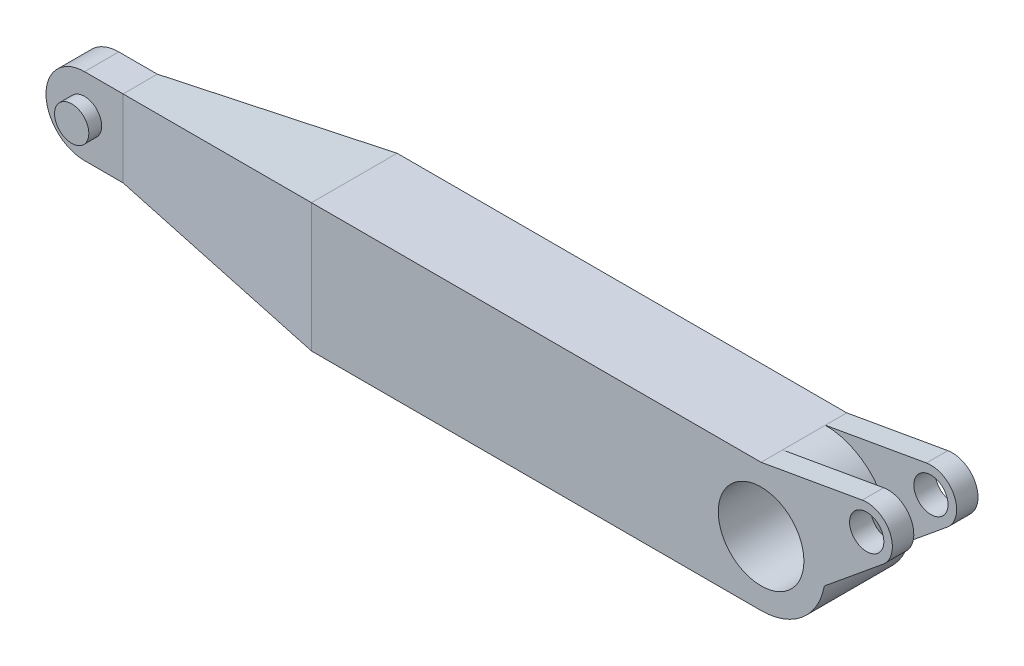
ISO-10303-21;
HEADER;
FILE_DESCRIPTION(('STEP AP214'),'2;1');
FILE_NAME('part.step','',(''),(''),'','','');
FILE_SCHEMA(('AUTOMOTIVE_DESIGN { 1 0 10303 214 1 1 1 1 }'));
ENDSEC;
DATA;
#1=APPLICATION_CONTEXT('core data for automotive mechanical design processes');
#2=APPLICATION_PROTOCOL_DEFINITION('international standard','automotive_design',2000,#1);
#3=PRODUCT_CONTEXT('',#1,'mechanical');
#4=PRODUCT('Part','Part','',(#3));
#5=PRODUCT_RELATED_PRODUCT_CATEGORY('part','',(#4));
#6=PRODUCT_DEFINITION_FORMATION('','',#4);
#7=PRODUCT_DEFINITION_CONTEXT('part definition',#1,'design');
#8=PRODUCT_DEFINITION('design','',#6,#7);
#9=PRODUCT_DEFINITION_SHAPE('','',#8);
#10=(LENGTH_UNIT() NAMED_UNIT(*) SI_UNIT(.MILLI.,.METRE.));
#11=(NAMED_UNIT(*) PLANE_ANGLE_UNIT() SI_UNIT($,.RADIAN.));
#12=(NAMED_UNIT(*) SI_UNIT($,.STERADIAN.) SOLID_ANGLE_UNIT());
#13=UNCERTAINTY_MEASURE_WITH_UNIT(LENGTH_MEASURE(1.E-05),#10,'distance_accuracy_value','');
#14=(GEOMETRIC_REPRESENTATION_CONTEXT(3) GLOBAL_UNCERTAINTY_ASSIGNED_CONTEXT((#13)) GLOBAL_UNIT_ASSIGNED_CONTEXT((#10,
#11,#12)) REPRESENTATION_CONTEXT('',''));
#15=CARTESIAN_POINT('',(0.,0.,0.));
#16=DIRECTION('',(0.,0.,1.));
#17=DIRECTION('',(1.,0.,0.));
#18=AXIS2_PLACEMENT_3D('',#15,#16,#17);
#19=CARTESIAN_POINT('',(0.,0.,0.));
#20=DIRECTION('',(0.,0.,1.));
#21=DIRECTION('',(1.,0.,0.));
#22=AXIS2_PLACEMENT_3D('',#19,#20,#21);
#23=CYLINDRICAL_SURFACE('',#22,150.);
#24=CARTESIAN_POINT('',(0.,0.,-50.));
#25=DIRECTION('',(0.,0.,1.));
#26=DIRECTION('',(1.,0.,0.));
#27=AXIS2_PLACEMENT_3D('',#24,#25,#26);
#28=CIRCLE('',#27,150.);
#29=CARTESIAN_POINT('',(150.,0.,-50.));
#30=VERTEX_POINT('',#29);
#31=CARTESIAN_POINT('',(0.,150.,-50.));
#32=VERTEX_POINT('',#31);
#33=EDGE_CURVE('E197',#30,#32,#28,.T.);
#34=ORIENTED_EDGE('',*,*,#33,.T.);
#35=DIRECTION('',(0.,0.,-1.));
#36=VECTOR('',#35,1.);
#37=CARTESIAN_POINT('',(0.,150.,-100.));
#38=LINE('',#37,#36);
#39=CARTESIAN_POINT('',(0.,150.,50.));
#40=VERTEX_POINT('',#39);
#41=EDGE_CURVE('E324',#40,#32,#38,.T.);
#42=ORIENTED_EDGE('',*,*,#41,.F.);
#43=CARTESIAN_POINT('',(0.,0.,50.));
#44=DIRECTION('',(0.,0.,1.));
#45=DIRECTION('',(1.,0.,0.));
#46=AXIS2_PLACEMENT_3D('',#43,#44,#45);
#47=CIRCLE('',#46,150.);
#48=CARTESIAN_POINT('',(150.,0.,50.));
#49=VERTEX_POINT('',#48);
#50=EDGE_CURVE('E206',#49,#40,#47,.T.);
#51=ORIENTED_EDGE('',*,*,#50,.F.);
#52=DIRECTION('',(0.,0.,-1.));
#53=VECTOR('',#52,1.);
#54=CARTESIAN_POINT('',(150.,0.,100.));
#55=LINE('',#54,#53);
#56=EDGE_CURVE('E246',#30,#49,#55,.F.);
#57=ORIENTED_EDGE('',*,*,#56,.F.);
#58=EDGE_LOOP('',(#34,#42,#51,#57));
#59=FACE_BOUND('',#58,.T.);
#60=ADVANCED_FACE('F42',(#59),#23,.T.);
#61=CARTESIAN_POINT('',(0.,0.,0.));
#62=DIRECTION('',(0.,0.,-1.));
#63=DIRECTION('',(-1.,0.,0.));
#64=AXIS2_PLACEMENT_3D('',#61,#62,#63);
#65=CYLINDRICAL_SURFACE('',#64,150.);
#66=DIRECTION('',(0.,0.,1.));
#67=VECTOR('',#66,1.);
#68=CARTESIAN_POINT('',(147.67042884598,-26.3333333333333,-476.747054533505));
#69=LINE('',#68,#67);
#70=CARTESIAN_POINT('',(147.67042884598,-26.3333333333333,-100.));
#71=VERTEX_POINT('',#70);
#72=CARTESIAN_POINT('',(147.67042884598,-26.3333333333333,-50.));
#73=VERTEX_POINT('',#72);
#74=EDGE_CURVE('E185',#71,#73,#69,.T.);
#75=ORIENTED_EDGE('',*,*,#74,.T.);
#76=EDGE_CURVE('E193',#73,#30,#28,.T.);
#77=ORIENTED_EDGE('',*,*,#76,.T.);
#78=ORIENTED_EDGE('',*,*,#56,.T.);
#79=CARTESIAN_POINT('',(147.67042884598,-26.3333333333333,50.));
#80=VERTEX_POINT('',#79);
#81=EDGE_CURVE('E202',#80,#49,#47,.T.);
#82=ORIENTED_EDGE('',*,*,#81,.F.);
#83=DIRECTION('',(0.,0.,-1.));
#84=VECTOR('',#83,1.);
#85=CARTESIAN_POINT('',(147.67042884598,-26.3333333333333,476.747054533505));
#86=LINE('',#85,#84);
#87=CARTESIAN_POINT('',(147.67042884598,-26.3333333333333,100.));
#88=VERTEX_POINT('',#87);
#89=EDGE_CURVE('E217',#88,#80,#86,.T.);
#90=ORIENTED_EDGE('',*,*,#89,.F.);
#91=CARTESIAN_POINT('',(0.,0.,100.));
#92=DIRECTION('',(0.,0.,-1.));
#93=DIRECTION('',(-1.,0.,0.));
#94=AXIS2_PLACEMENT_3D('',#91,#92,#93);
#95=CIRCLE('',#94,150.);
#96=CARTESIAN_POINT('',(0.,-150.,100.));
#97=VERTEX_POINT('',#96);
#98=EDGE_CURVE('E56',#97,#88,#95,.F.);
#99=ORIENTED_EDGE('',*,*,#98,.F.);
#100=DIRECTION('',(0.,0.,-1.));
#101=VECTOR('',#100,1.);
#102=CARTESIAN_POINT('',(0.,-150.,0.));
#103=LINE('',#102,#101);
#104=CARTESIAN_POINT('',(0.,-150.,-100.));
#105=VERTEX_POINT('',#104);
#106=EDGE_CURVE('E321',#105,#97,#103,.F.);
#107=ORIENTED_EDGE('',*,*,#106,.F.);
#108=CARTESIAN_POINT('',(0.,0.,-100.));
#109=DIRECTION('',(0.,0.,-1.));
#110=DIRECTION('',(-1.,0.,0.));
#111=AXIS2_PLACEMENT_3D('',#108,#109,#110);
#112=CIRCLE('',#111,150.);
#113=EDGE_CURVE('E317',#71,#105,#112,.T.);
#114=ORIENTED_EDGE('',*,*,#113,.F.);
#115=EDGE_LOOP('',(#75,#77,#78,#82,#90,#99,#107,#114));
#116=FACE_BOUND('',#115,.T.);
#117=ADVANCED_FACE('F329',(#116),#65,.T.);
#118=CARTESIAN_POINT('',(0.,150.,40.));
#119=DIRECTION('',(0.,0.,1.));
#120=DIRECTION('',(1.,0.,0.));
#121=AXIS2_PLACEMENT_3D('',#118,#119,#120);
#122=PLANE('',#121);
#123=CARTESIAN_POINT('',(-1640.,0.,40.0000000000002));
#124=DIRECTION('',(0.,0.,1.));
#125=DIRECTION('',(1.,0.,0.));
#126=AXIS2_PLACEMENT_3D('',#123,#124,#125);
#127=CIRCLE('',#126,39.9999999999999);
#128=CARTESIAN_POINT('',(-1600.,0.,40.0000000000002));
#129=VERTEX_POINT('',#128);
#130=EDGE_CURVE('E235',#129,#129,#127,.F.);
#131=ORIENTED_EDGE('',*,*,#130,.T.);
#132=EDGE_LOOP('',(#131));
#133=FACE_BOUND('',#132,.T.);
#134=CARTESIAN_POINT('',(-1640.,0.,40.0000000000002));
#135=DIRECTION('',(0.,0.,1.));
#136=DIRECTION('',(1.,0.,0.));
#137=AXIS2_PLACEMENT_3D('',#134,#135,#136);
#138=CIRCLE('',#137,90.);
#139=CARTESIAN_POINT('',(-1640.,90.,40.0000000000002));
#140=VERTEX_POINT('',#139);
#141=CARTESIAN_POINT('',(-1730.,0.,40.0000000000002));
#142=VERTEX_POINT('',#141);
#143=EDGE_CURVE('E304',#140,#142,#138,.T.);
#144=ORIENTED_EDGE('',*,*,#143,.T.);
#145=CARTESIAN_POINT('',(-1640.,0.,40.0000000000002));
#146=DIRECTION('',(0.,0.,1.));
#147=DIRECTION('',(1.,0.,0.));
#148=AXIS2_PLACEMENT_3D('',#145,#146,#147);
#149=CIRCLE('',#148,90.);
#150=CARTESIAN_POINT('',(-1640.,-90.,40.0000000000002));
#151=VERTEX_POINT('',#150);
#152=EDGE_CURVE('E306',#142,#151,#149,.T.);
#153=ORIENTED_EDGE('',*,*,#152,.T.);
#154=DIRECTION('',(-1.,0.,0.));
#155=VECTOR('',#154,1.);
#156=CARTESIAN_POINT('',(0.,-89.9999999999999,40.));
#157=LINE('',#156,#155);
#158=CARTESIAN_POINT('',(-1550.,-90.0000000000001,40.0000000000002));
#159=VERTEX_POINT('',#158);
#160=EDGE_CURVE('E269',#159,#151,#157,.T.);
#161=ORIENTED_EDGE('',*,*,#160,.F.);
#162=DIRECTION('',(0.,-1.,0.));
#163=VECTOR('',#162,1.);
#164=CARTESIAN_POINT('',(-1550.,150.,40.0000000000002));
#165=LINE('',#164,#163);
#166=CARTESIAN_POINT('',(-1550.,90.0000000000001,40.0000000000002));
#167=VERTEX_POINT('',#166);
#168=EDGE_CURVE('E295',#167,#159,#165,.T.);
#169=ORIENTED_EDGE('',*,*,#168,.F.);
#170=DIRECTION('',(-1.,0.,0.));
#171=VECTOR('',#170,1.);
#172=CARTESIAN_POINT('',(0.,90.,40.));
#173=LINE('',#172,#171);
#174=EDGE_CURVE('E272',#167,#140,#173,.T.);
#175=ORIENTED_EDGE('',*,*,#174,.T.);
#176=EDGE_LOOP('',(#144,#153,#161,#169,#175));
#177=FACE_BOUND('',#176,.T.);
#178=ADVANCED_FACE('F396',(#133,#177),#122,.T.);
#179=CARTESIAN_POINT('',(0.,150.,-40.0000000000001));
#180=DIRECTION('',(0.,0.,1.));
#181=DIRECTION('',(1.,0.,0.));
#182=AXIS2_PLACEMENT_3D('',#179,#180,#181);
#183=PLANE('',#182);
#184=CARTESIAN_POINT('',(-1640.,0.,-39.9999999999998));
#185=DIRECTION('',(0.,0.,1.));
#186=DIRECTION('',(1.,0.,0.));
#187=AXIS2_PLACEMENT_3D('',#184,#185,#186);
#188=CIRCLE('',#187,39.9999999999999);
#189=CARTESIAN_POINT('',(-1600.,0.,-39.9999999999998));
#190=VERTEX_POINT('',#189);
#191=EDGE_CURVE('E11',#190,#190,#188,.F.);
#192=ORIENTED_EDGE('',*,*,#191,.F.);
#193=EDGE_LOOP('',(#192));
#194=FACE_BOUND('',#193,.T.);
#195=DIRECTION('',(-1.,0.,0.));
#196=VECTOR('',#195,1.);
#197=CARTESIAN_POINT('',(0.,-89.9999999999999,-40.0000000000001));
#198=LINE('',#197,#196);
#199=CARTESIAN_POINT('',(-1550.,-90.,-39.9999999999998));
#200=VERTEX_POINT('',#199);
#201=CARTESIAN_POINT('',(-1640.,-90.,-39.9999999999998));
#202=VERTEX_POINT('',#201);
#203=EDGE_CURVE('E298',#200,#202,#198,.T.);
#204=ORIENTED_EDGE('',*,*,#203,.T.);
#205=CARTESIAN_POINT('',(-1640.,0.,-39.9999999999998));
#206=DIRECTION('',(0.,0.,1.));
#207=DIRECTION('',(1.,0.,0.));
#208=AXIS2_PLACEMENT_3D('',#205,#206,#207);
#209=CIRCLE('',#208,90.);
#210=CARTESIAN_POINT('',(-1730.,0.,-39.9999999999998));
#211=VERTEX_POINT('',#210);
#212=EDGE_CURVE('E313',#202,#211,#209,.F.);
#213=ORIENTED_EDGE('',*,*,#212,.T.);
#214=CARTESIAN_POINT('',(-1640.,0.,-39.9999999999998));
#215=DIRECTION('',(0.,0.,1.));
#216=DIRECTION('',(1.,0.,0.));
#217=AXIS2_PLACEMENT_3D('',#214,#215,#216);
#218=CIRCLE('',#217,90.);
#219=CARTESIAN_POINT('',(-1640.,90.,-39.9999999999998));
#220=VERTEX_POINT('',#219);
#221=EDGE_CURVE('E311',#211,#220,#218,.F.);
#222=ORIENTED_EDGE('',*,*,#221,.T.);
#223=DIRECTION('',(-1.,0.,0.));
#224=VECTOR('',#223,1.);
#225=CARTESIAN_POINT('',(0.,90.,-40.0000000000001));
#226=LINE('',#225,#224);
#227=CARTESIAN_POINT('',(-1550.,90.0000000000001,-39.9999999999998));
#228=VERTEX_POINT('',#227);
#229=EDGE_CURVE('E301',#228,#220,#226,.T.);
#230=ORIENTED_EDGE('',*,*,#229,.F.);
#231=DIRECTION('',(0.,-1.,0.));
#232=VECTOR('',#231,1.);
#233=CARTESIAN_POINT('',(-1550.,150.,-39.9999999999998));
#234=LINE('',#233,#232);
#235=EDGE_CURVE('E282',#228,#200,#234,.T.);
#236=ORIENTED_EDGE('',*,*,#235,.T.);
#237=EDGE_LOOP('',(#204,#213,#222,#230,#236));
#238=FACE_BOUND('',#237,.T.);
#239=ADVANCED_FACE('F400',(#194,#238),#183,.F.);
#240=CARTESIAN_POINT('',(-26.7350157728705,150.,222.791798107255));
#241=DIRECTION('',(0.11914522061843,0.,-0.992876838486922));
#242=DIRECTION('',(-0.992876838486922,0.,-0.11914522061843));
#243=AXIS2_PLACEMENT_3D('',#240,#241,#242);
#244=PLANE('',#243);
#245=DIRECTION('',(0.,-1.,0.));
#246=VECTOR('',#245,1.);
#247=CARTESIAN_POINT('',(-1050.,150.,100.));
#248=LINE('',#247,#246);
#249=CARTESIAN_POINT('',(-1050.,150.,100.));
#250=VERTEX_POINT('',#249);
#251=CARTESIAN_POINT('',(-1050.,-150.,100.));
#252=VERTEX_POINT('',#251);
#253=EDGE_CURVE('E292',#250,#252,#248,.T.);
#254=ORIENTED_EDGE('',*,*,#253,.F.);
#255=DIRECTION('',(-0.985903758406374,-0.118308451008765,-0.118308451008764));
#256=VECTOR('',#255,1.);
#257=CARTESIAN_POINT('',(-41.0575427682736,271.073094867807,221.073094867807));
#258=LINE('',#257,#256);
#259=EDGE_CURVE('E266',#250,#167,#258,.T.);
#260=ORIENTED_EDGE('',*,*,#259,.T.);
#261=ORIENTED_EDGE('',*,*,#168,.T.);
#262=DIRECTION('',(0.985903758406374,-0.118308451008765,0.118308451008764));
#263=VECTOR('',#262,1.);
#264=CARTESIAN_POINT('',(-76.0497667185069,-266.874027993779,216.874027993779));
#265=LINE('',#264,#263);
#266=EDGE_CURVE('E261',#159,#252,#265,.T.);
#267=ORIENTED_EDGE('',*,*,#266,.T.);
#268=EDGE_LOOP('',(#254,#260,#261,#267));
#269=FACE_BOUND('',#268,.T.);
#270=ADVANCED_FACE('F414',(#269),#244,.F.);
#271=CARTESIAN_POINT('',(0.,150.,100.));
#272=DIRECTION('',(0.,0.,-1.));
#273=DIRECTION('',(-1.,0.,0.));
#274=AXIS2_PLACEMENT_3D('',#271,#272,#273);
#275=PLANE('',#274);
#276=DIRECTION('',(0.984807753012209,0.173648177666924,0.));
#277=VECTOR('',#276,1.);
#278=CARTESIAN_POINT('',(-25.6515107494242,145.476946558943,100.));
#279=LINE('',#278,#277);
#280=CARTESIAN_POINT('',(0.,150.,100.));
#281=VERTEX_POINT('',#280);
#282=CARTESIAN_POINT('',(236.212921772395,191.65071130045,100.));
#283=VERTEX_POINT('',#282);
#284=EDGE_CURVE('E211',#281,#283,#279,.T.);
#285=ORIENTED_EDGE('',*,*,#284,.F.);
#286=DIRECTION('',(1.,0.,0.));
#287=VECTOR('',#286,1.);
#288=CARTESIAN_POINT('',(0.,150.,100.));
#289=LINE('',#288,#287);
#290=EDGE_CURVE('E276',#250,#281,#289,.T.);
#291=ORIENTED_EDGE('',*,*,#290,.F.);
#292=ORIENTED_EDGE('',*,*,#253,.T.);
#293=DIRECTION('',(1.,0.,0.));
#294=VECTOR('',#293,1.);
#295=CARTESIAN_POINT('',(0.,-150.,100.));
#296=LINE('',#295,#294);
#297=EDGE_CURVE('E275',#252,#97,#296,.T.);
#298=ORIENTED_EDGE('',*,*,#297,.T.);
#299=ORIENTED_EDGE('',*,*,#98,.T.);
#300=DIRECTION('',(-0.772840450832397,-0.63460037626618,0.));
#301=VECTOR('',#300,1.);
#302=CARTESIAN_POINT('',(72.3845337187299,-88.1526355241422,100.));
#303=LINE('',#302,#301);
#304=CARTESIAN_POINT('',(284.707835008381,86.1918190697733,100.));
#305=VERTEX_POINT('',#304);
#306=EDGE_CURVE('E221',#305,#88,#303,.T.);
#307=ORIENTED_EDGE('',*,*,#306,.F.);
#308=CARTESIAN_POINT('',(246.63181243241,132.562246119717,100.));
#309=DIRECTION('',(0.,0.,-1.));
#310=DIRECTION('',(-1.,0.,0.));
#311=AXIS2_PLACEMENT_3D('',#308,#309,#310);
#312=CIRCLE('',#311,60.);
#313=EDGE_CURVE('E216',#283,#305,#312,.T.);
#314=ORIENTED_EDGE('',*,*,#313,.F.);
#315=EDGE_LOOP('',(#285,#291,#292,#298,#299,#307,#314));
#316=FACE_BOUND('',#315,.T.);
#317=CARTESIAN_POINT('',(0.,0.,100.));
#318=DIRECTION('',(0.,0.,1.));
#319=DIRECTION('',(1.,0.,0.));
#320=AXIS2_PLACEMENT_3D('',#317,#318,#319);
#321=CIRCLE('',#320,100.);
#322=CARTESIAN_POINT('',(100.,0.,100.));
#323=VERTEX_POINT('',#322);
#324=EDGE_CURVE('E240',#323,#323,#321,.T.);
#325=ORIENTED_EDGE('',*,*,#324,.F.);
#326=EDGE_LOOP('',(#325));
#327=FACE_BOUND('',#326,.T.);
#328=CARTESIAN_POINT('',(246.63181243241,132.562246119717,100.));
#329=DIRECTION('',(0.,0.,-1.));
#330=DIRECTION('',(-1.,0.,0.));
#331=AXIS2_PLACEMENT_3D('',#328,#329,#330);
#332=CIRCLE('',#331,40.);
#333=CARTESIAN_POINT('',(206.63181243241,132.562246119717,100.));
#334=VERTEX_POINT('',#333);
#335=EDGE_CURVE('E201',#334,#334,#332,.T.);
#336=ORIENTED_EDGE('',*,*,#335,.T.);
#337=EDGE_LOOP('',(#336));
#338=FACE_BOUND('',#337,.T.);
#339=ADVANCED_FACE('F354',(#316,#327,#338),#275,.F.);
#340=CARTESIAN_POINT('',(0.,150.,-100.));
#341=DIRECTION('',(0.,0.,-1.));
#342=DIRECTION('',(-1.,0.,0.));
#343=AXIS2_PLACEMENT_3D('',#340,#341,#342);
#344=PLANE('',#343);
#345=CARTESIAN_POINT('',(0.,0.,-100.));
#346=DIRECTION('',(0.,0.,1.));
#347=DIRECTION('',(1.,0.,0.));
#348=AXIS2_PLACEMENT_3D('',#345,#346,#347);
#349=CIRCLE('',#348,100.);
#350=CARTESIAN_POINT('',(100.,0.,-100.));
#351=VERTEX_POINT('',#350);
#352=EDGE_CURVE('E243',#351,#351,#349,.T.);
#353=ORIENTED_EDGE('',*,*,#352,.T.);
#354=EDGE_LOOP('',(#353));
#355=FACE_BOUND('',#354,.T.);
#356=DIRECTION('',(1.,0.,0.));
#357=VECTOR('',#356,1.);
#358=CARTESIAN_POINT('',(0.,150.,-100.));
#359=LINE('',#358,#357);
#360=CARTESIAN_POINT('',(-1050.,150.,-100.));
#361=VERTEX_POINT('',#360);
#362=CARTESIAN_POINT('',(0.,150.,-100.));
#363=VERTEX_POINT('',#362);
#364=EDGE_CURVE('E279',#361,#363,#359,.T.);
#365=ORIENTED_EDGE('',*,*,#364,.T.);
#366=DIRECTION('',(-0.984807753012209,-0.173648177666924,0.));
#367=VECTOR('',#366,1.);
#368=CARTESIAN_POINT('',(-25.6515107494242,145.476946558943,-100.));
#369=LINE('',#368,#367);
#370=CARTESIAN_POINT('',(236.212921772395,191.65071130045,-100.));
#371=VERTEX_POINT('',#370);
#372=EDGE_CURVE('E64',#371,#363,#369,.T.);
#373=ORIENTED_EDGE('',*,*,#372,.F.);
#374=CARTESIAN_POINT('',(246.63181243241,132.562246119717,-100.));
#375=DIRECTION('',(0.,0.,-1.));
#376=DIRECTION('',(-1.,0.,0.));
#377=AXIS2_PLACEMENT_3D('',#374,#375,#376);
#378=CIRCLE('',#377,60.);
#379=CARTESIAN_POINT('',(284.707835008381,86.1918190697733,-100.));
#380=VERTEX_POINT('',#379);
#381=EDGE_CURVE('E161',#380,#371,#378,.F.);
#382=ORIENTED_EDGE('',*,*,#381,.F.);
#383=DIRECTION('',(0.772840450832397,0.63460037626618,0.));
#384=VECTOR('',#383,1.);
#385=CARTESIAN_POINT('',(72.3845337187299,-88.1526355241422,-100.));
#386=LINE('',#385,#384);
#387=EDGE_CURVE('E167',#71,#380,#386,.T.);
#388=ORIENTED_EDGE('',*,*,#387,.F.);
#389=ORIENTED_EDGE('',*,*,#113,.T.);
#390=DIRECTION('',(1.,0.,0.));
#391=VECTOR('',#390,1.);
#392=CARTESIAN_POINT('',(0.,-150.,-100.));
#393=LINE('',#392,#391);
#394=CARTESIAN_POINT('',(-1050.,-150.,-100.));
#395=VERTEX_POINT('',#394);
#396=EDGE_CURVE('E280',#395,#105,#393,.T.);
#397=ORIENTED_EDGE('',*,*,#396,.F.);
#398=DIRECTION('',(0.,-1.,0.));
#399=VECTOR('',#398,1.);
#400=CARTESIAN_POINT('',(-1050.,150.,-100.));
#401=LINE('',#400,#399);
#402=EDGE_CURVE('E289',#361,#395,#401,.T.);
#403=ORIENTED_EDGE('',*,*,#402,.F.);
#404=EDGE_LOOP('',(#365,#373,#382,#388,#389,#397,#403));
#405=FACE_BOUND('',#404,.T.);
#406=CARTESIAN_POINT('',(246.63181243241,132.562246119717,-100.));
#407=DIRECTION('',(0.,0.,-1.));
#408=DIRECTION('',(-1.,0.,0.));
#409=AXIS2_PLACEMENT_3D('',#406,#407,#408);
#410=CIRCLE('',#409,40.);
#411=CARTESIAN_POINT('',(206.63181243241,132.562246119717,-100.));
#412=VERTEX_POINT('',#411);
#413=EDGE_CURVE('E191',#412,#412,#410,.F.);
#414=ORIENTED_EDGE('',*,*,#413,.T.);
#415=EDGE_LOOP('',(#414));
#416=FACE_BOUND('',#415,.T.);
#417=ADVANCED_FACE('F164',(#355,#405,#416),#344,.T.);
#418=CARTESIAN_POINT('',(-26.7350157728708,150.,-222.791798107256));
#419=DIRECTION('',(-0.119145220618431,0.,-0.992876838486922));
#420=DIRECTION('',(-0.992876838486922,0.,0.119145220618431));
#421=AXIS2_PLACEMENT_3D('',#418,#419,#420);
#422=PLANE('',#421);
#423=DIRECTION('',(-0.985903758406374,-0.118308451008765,0.118308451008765));
#424=VECTOR('',#423,1.);
#425=CARTESIAN_POINT('',(-41.0575427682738,271.073094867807,-221.073094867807));
#426=LINE('',#425,#424);
#427=EDGE_CURVE('E264',#361,#228,#426,.T.);
#428=ORIENTED_EDGE('',*,*,#427,.F.);
#429=ORIENTED_EDGE('',*,*,#402,.T.);
#430=DIRECTION('',(0.985903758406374,-0.118308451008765,-0.118308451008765));
#431=VECTOR('',#430,1.);
#432=CARTESIAN_POINT('',(-76.0497667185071,-266.874027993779,-216.874027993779));
#433=LINE('',#432,#431);
#434=EDGE_CURVE('E250',#200,#395,#433,.T.);
#435=ORIENTED_EDGE('',*,*,#434,.F.);
#436=ORIENTED_EDGE('',*,*,#235,.F.);
#437=EDGE_LOOP('',(#428,#429,#435,#436));
#438=FACE_BOUND('',#437,.T.);
#439=ADVANCED_FACE('F422',(#438),#422,.T.);
#440=CARTESIAN_POINT('',(0.,150.,0.));
#441=DIRECTION('',(0.,1.,0.));
#442=DIRECTION('',(0.,0.,1.));
#443=AXIS2_PLACEMENT_3D('',#440,#441,#442);
#444=PLANE('',#443);
#445=ORIENTED_EDGE('',*,*,#290,.T.);
#446=EDGE_CURVE('E49',#281,#40,#38,.T.);
#447=ORIENTED_EDGE('',*,*,#446,.T.);
#448=ORIENTED_EDGE('',*,*,#41,.T.);
#449=DIRECTION('',(0.,0.,1.));
#450=VECTOR('',#449,1.);
#451=CARTESIAN_POINT('',(0.,150.,-476.747054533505));
#452=LINE('',#451,#450);
#453=EDGE_CURVE('E171',#363,#32,#452,.T.);
#454=ORIENTED_EDGE('',*,*,#453,.F.);
#455=ORIENTED_EDGE('',*,*,#364,.F.);
#456=DIRECTION('',(0.,0.,1.));
#457=VECTOR('',#456,1.);
#458=CARTESIAN_POINT('',(-1050.,150.,-100.));
#459=LINE('',#458,#457);
#460=EDGE_CURVE('E247',#361,#250,#459,.T.);
#461=ORIENTED_EDGE('',*,*,#460,.T.);
#462=EDGE_LOOP('',(#445,#447,#448,#454,#455,#461));
#463=FACE_BOUND('',#462,.T.);
#464=ADVANCED_FACE('F343',(#463),#444,.T.);
#465=CARTESIAN_POINT('',(0.,-150.,0.));
#466=DIRECTION('',(0.,1.,0.));
#467=DIRECTION('',(0.,0.,1.));
#468=AXIS2_PLACEMENT_3D('',#465,#466,#467);
#469=PLANE('',#468);
#470=ORIENTED_EDGE('',*,*,#396,.T.);
#471=ORIENTED_EDGE('',*,*,#106,.T.);
#472=ORIENTED_EDGE('',*,*,#297,.F.);
#473=DIRECTION('',(0.,0.,1.));
#474=VECTOR('',#473,1.);
#475=CARTESIAN_POINT('',(-1050.,-150.,-100.));
#476=LINE('',#475,#474);
#477=EDGE_CURVE('E257',#395,#252,#476,.T.);
#478=ORIENTED_EDGE('',*,*,#477,.F.);
#479=EDGE_LOOP('',(#470,#471,#472,#478));
#480=FACE_BOUND('',#479,.T.);
#481=ADVANCED_FACE('F360',(#480),#469,.F.);
#482=CARTESIAN_POINT('',(0.,-89.9999999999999,-100.));
#483=DIRECTION('',(0.,1.,0.));
#484=DIRECTION('',(-1.,0.,0.));
#485=AXIS2_PLACEMENT_3D('',#482,#483,#484);
#486=PLANE('',#485);
#487=ORIENTED_EDGE('',*,*,#160,.T.);
#488=DIRECTION('',(0.,0.,1.));
#489=VECTOR('',#488,1.);
#490=CARTESIAN_POINT('',(-1640.,-90.,-39.9999999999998));
#491=LINE('',#490,#489);
#492=EDGE_CURVE('E308',#151,#202,#491,.F.);
#493=ORIENTED_EDGE('',*,*,#492,.T.);
#494=ORIENTED_EDGE('',*,*,#203,.F.);
#495=DIRECTION('',(0.,0.,1.));
#496=VECTOR('',#495,1.);
#497=CARTESIAN_POINT('',(-1550.,-90.,-100.));
#498=LINE('',#497,#496);
#499=EDGE_CURVE('E254',#200,#159,#498,.T.);
#500=ORIENTED_EDGE('',*,*,#499,.T.);
#501=EDGE_LOOP('',(#487,#493,#494,#500));
#502=FACE_BOUND('',#501,.T.);
#503=ADVANCED_FACE('F431',(#502),#486,.F.);
#504=CARTESIAN_POINT('',(-32.6498422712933,-272.082018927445,-100.));
#505=DIRECTION('',(0.119145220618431,0.992876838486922,0.));
#506=DIRECTION('',(-0.992876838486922,0.119145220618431,0.));
#507=AXIS2_PLACEMENT_3D('',#504,#505,#506);
#508=PLANE('',#507);
#509=ORIENTED_EDGE('',*,*,#499,.F.);
#510=ORIENTED_EDGE('',*,*,#434,.T.);
#511=ORIENTED_EDGE('',*,*,#477,.T.);
#512=ORIENTED_EDGE('',*,*,#266,.F.);
#513=EDGE_LOOP('',(#509,#510,#511,#512));
#514=FACE_BOUND('',#513,.T.);
#515=ADVANCED_FACE('F434',(#514),#508,.F.);
#516=CARTESIAN_POINT('',(0.,90.,-100.));
#517=DIRECTION('',(0.,1.,0.));
#518=DIRECTION('',(0.,0.,1.));
#519=AXIS2_PLACEMENT_3D('',#516,#517,#518);
#520=PLANE('',#519);
#521=ORIENTED_EDGE('',*,*,#229,.T.);
#522=DIRECTION('',(0.,0.,1.));
#523=VECTOR('',#522,1.);
#524=CARTESIAN_POINT('',(-1640.,90.,-100.));
#525=LINE('',#524,#523);
#526=EDGE_CURVE('E315',#220,#140,#525,.T.);
#527=ORIENTED_EDGE('',*,*,#526,.T.);
#528=ORIENTED_EDGE('',*,*,#174,.F.);
#529=DIRECTION('',(0.,0.,1.));
#530=VECTOR('',#529,1.);
#531=CARTESIAN_POINT('',(-1550.,90.0000000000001,-100.));
#532=LINE('',#531,#530);
#533=EDGE_CURVE('E251',#228,#167,#532,.T.);
#534=ORIENTED_EDGE('',*,*,#533,.F.);
#535=EDGE_LOOP('',(#521,#527,#528,#534));
#536=FACE_BOUND('',#535,.T.);
#537=ADVANCED_FACE('F437',(#536),#520,.T.);
#538=CARTESIAN_POINT('',(-32.6498422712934,272.082018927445,-100.));
#539=DIRECTION('',(0.119145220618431,-0.992876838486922,0.));
#540=DIRECTION('',(0.992876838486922,0.119145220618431,0.));
#541=AXIS2_PLACEMENT_3D('',#538,#539,#540);
#542=PLANE('',#541);
#543=ORIENTED_EDGE('',*,*,#460,.F.);
#544=ORIENTED_EDGE('',*,*,#427,.T.);
#545=ORIENTED_EDGE('',*,*,#533,.T.);
#546=ORIENTED_EDGE('',*,*,#259,.F.);
#547=EDGE_LOOP('',(#543,#544,#545,#546));
#548=FACE_BOUND('',#547,.T.);
#549=ADVANCED_FACE('F408',(#548),#542,.F.);
#550=CARTESIAN_POINT('',(-1640.,0.,-100.));
#551=DIRECTION('',(0.,0.,1.));
#552=DIRECTION('',(1.,0.,0.));
#553=AXIS2_PLACEMENT_3D('',#550,#551,#552);
#554=CYLINDRICAL_SURFACE('',#553,90.);
#555=ORIENTED_EDGE('',*,*,#526,.F.);
#556=ORIENTED_EDGE('',*,*,#221,.F.);
#557=DIRECTION('',(0.,0.,1.));
#558=VECTOR('',#557,1.);
#559=CARTESIAN_POINT('',(-1730.,0.,0.));
#560=LINE('',#559,#558);
#561=EDGE_CURVE('E259',#142,#211,#560,.F.);
#562=ORIENTED_EDGE('',*,*,#561,.F.);
#563=ORIENTED_EDGE('',*,*,#143,.F.);
#564=EDGE_LOOP('',(#555,#556,#562,#563));
#565=FACE_BOUND('',#564,.T.);
#566=ADVANCED_FACE('F404',(#565),#554,.T.);
#567=CARTESIAN_POINT('',(-1640.,0.,0.));
#568=DIRECTION('',(0.,0.,-1.));
#569=DIRECTION('',(-1.,0.,0.));
#570=AXIS2_PLACEMENT_3D('',#567,#568,#569);
#571=CYLINDRICAL_SURFACE('',#570,90.);
#572=ORIENTED_EDGE('',*,*,#212,.F.);
#573=ORIENTED_EDGE('',*,*,#492,.F.);
#574=ORIENTED_EDGE('',*,*,#152,.F.);
#575=ORIENTED_EDGE('',*,*,#561,.T.);
#576=EDGE_LOOP('',(#572,#573,#574,#575));
#577=FACE_BOUND('',#576,.T.);
#578=ADVANCED_FACE('F407',(#577),#571,.T.);
#579=CARTESIAN_POINT('',(0.,0.,-100.));
#580=DIRECTION('',(0.,0.,1.));
#581=DIRECTION('',(1.,0.,0.));
#582=AXIS2_PLACEMENT_3D('',#579,#580,#581);
#583=CYLINDRICAL_SURFACE('',#582,100.);
#584=ORIENTED_EDGE('',*,*,#352,.F.);
#585=EDGE_LOOP('',(#584));
#586=FACE_BOUND('',#585,.T.);
#587=ORIENTED_EDGE('',*,*,#324,.T.);
#588=EDGE_LOOP('',(#587));
#589=FACE_BOUND('',#588,.T.);
#590=ADVANCED_FACE('F411',(#586,#589),#583,.F.);
#591=CARTESIAN_POINT('',(-1640.,0.,-70.));
#592=DIRECTION('',(0.,0.,1.));
#593=DIRECTION('',(1.,0.,0.));
#594=AXIS2_PLACEMENT_3D('',#591,#592,#593);
#595=PLANE('',#594);
#596=CARTESIAN_POINT('',(-1640.,0.,-70.));
#597=DIRECTION('',(0.,0.,1.));
#598=DIRECTION('',(1.,0.,0.));
#599=AXIS2_PLACEMENT_3D('',#596,#597,#598);
#600=CIRCLE('',#599,39.9999999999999);
#601=CARTESIAN_POINT('',(-1600.,0.,-70.));
#602=VERTEX_POINT('',#601);
#603=EDGE_CURVE('E231',#602,#602,#600,.T.);
#604=ORIENTED_EDGE('',*,*,#603,.F.);
#605=EDGE_LOOP('',(#604));
#606=FACE_BOUND('',#605,.T.);
#607=ADVANCED_FACE('F450',(#606),#595,.F.);
#608=CARTESIAN_POINT('',(-1640.,0.,70.));
#609=DIRECTION('',(0.,0.,-1.));
#610=DIRECTION('',(-1.,0.,0.));
#611=AXIS2_PLACEMENT_3D('',#608,#609,#610);
#612=CYLINDRICAL_SURFACE('',#611,39.9999999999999);
#613=ORIENTED_EDGE('',*,*,#603,.T.);
#614=EDGE_LOOP('',(#613));
#615=FACE_BOUND('',#614,.T.);
#616=ORIENTED_EDGE('',*,*,#191,.T.);
#617=EDGE_LOOP('',(#616));
#618=FACE_BOUND('',#617,.T.);
#619=ADVANCED_FACE('F456',(#615,#618),#612,.T.);
#620=ORIENTED_EDGE('',*,*,#130,.F.);
#621=EDGE_LOOP('',(#620));
#622=FACE_BOUND('',#621,.T.);
#623=CARTESIAN_POINT('',(-1640.,0.,70.));
#624=DIRECTION('',(0.,0.,1.));
#625=DIRECTION('',(1.,0.,0.));
#626=AXIS2_PLACEMENT_3D('',#623,#624,#625);
#627=CIRCLE('',#626,39.9999999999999);
#628=CARTESIAN_POINT('',(-1600.,0.,70.));
#629=VERTEX_POINT('',#628);
#630=EDGE_CURVE('E232',#629,#629,#627,.T.);
#631=ORIENTED_EDGE('',*,*,#630,.F.);
#632=EDGE_LOOP('',(#631));
#633=FACE_BOUND('',#632,.T.);
#634=ADVANCED_FACE('F452',(#622,#633),#612,.T.);
#635=CARTESIAN_POINT('',(-1640.,0.,70.));
#636=DIRECTION('',(0.,0.,1.));
#637=DIRECTION('',(1.,0.,0.));
#638=AXIS2_PLACEMENT_3D('',#635,#636,#637);
#639=PLANE('',#638);
#640=ORIENTED_EDGE('',*,*,#630,.T.);
#641=EDGE_LOOP('',(#640));
#642=FACE_BOUND('',#641,.T.);
#643=ADVANCED_FACE('F455',(#642),#639,.T.);
#644=CARTESIAN_POINT('',(72.3845337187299,-88.1526355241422,476.747054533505));
#645=DIRECTION('',(-0.63460037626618,0.772840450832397,0.));
#646=DIRECTION('',(-0.772840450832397,-0.63460037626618,0.));
#647=AXIS2_PLACEMENT_3D('',#644,#645,#646);
#648=PLANE('',#647);
#649=DIRECTION('',(0.,0.,-1.));
#650=VECTOR('',#649,1.);
#651=CARTESIAN_POINT('',(284.707835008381,86.1918190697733,476.747054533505));
#652=LINE('',#651,#650);
#653=CARTESIAN_POINT('',(284.707835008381,86.1918190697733,50.));
#654=VERTEX_POINT('',#653);
#655=EDGE_CURVE('E212',#305,#654,#652,.T.);
#656=ORIENTED_EDGE('',*,*,#655,.F.);
#657=ORIENTED_EDGE('',*,*,#306,.T.);
#658=ORIENTED_EDGE('',*,*,#89,.T.);
#659=DIRECTION('',(0.772840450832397,0.63460037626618,0.));
#660=VECTOR('',#659,1.);
#661=CARTESIAN_POINT('',(72.3845337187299,-88.1526355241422,50.));
#662=LINE('',#661,#660);
#663=EDGE_CURVE('E213',#80,#654,#662,.T.);
#664=ORIENTED_EDGE('',*,*,#663,.T.);
#665=EDGE_LOOP('',(#656,#657,#658,#664));
#666=FACE_BOUND('',#665,.T.);
#667=ADVANCED_FACE('F352',(#666),#648,.F.);
#668=CARTESIAN_POINT('',(246.63181243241,132.562246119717,476.747054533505));
#669=DIRECTION('',(0.,0.,-1.));
#670=DIRECTION('',(-1.,0.,0.));
#671=AXIS2_PLACEMENT_3D('',#668,#669,#670);
#672=CYLINDRICAL_SURFACE('',#671,60.);
#673=DIRECTION('',(0.,0.,-1.));
#674=VECTOR('',#673,1.);
#675=CARTESIAN_POINT('',(236.212921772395,191.65071130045,476.747054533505));
#676=LINE('',#675,#674);
#677=CARTESIAN_POINT('',(236.212921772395,191.65071130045,50.));
#678=VERTEX_POINT('',#677);
#679=EDGE_CURVE('E207',#283,#678,#676,.T.);
#680=ORIENTED_EDGE('',*,*,#679,.F.);
#681=ORIENTED_EDGE('',*,*,#313,.T.);
#682=ORIENTED_EDGE('',*,*,#655,.T.);
#683=CARTESIAN_POINT('',(246.63181243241,132.562246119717,50.));
#684=DIRECTION('',(0.,0.,1.));
#685=DIRECTION('',(1.,0.,0.));
#686=AXIS2_PLACEMENT_3D('',#683,#684,#685);
#687=CIRCLE('',#686,60.);
#688=EDGE_CURVE('E208',#654,#678,#687,.T.);
#689=ORIENTED_EDGE('',*,*,#688,.T.);
#690=EDGE_LOOP('',(#680,#681,#682,#689));
#691=FACE_BOUND('',#690,.T.);
#692=ADVANCED_FACE('F349',(#691),#672,.T.);
#693=CARTESIAN_POINT('',(-25.6515107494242,145.476946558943,476.747054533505));
#694=DIRECTION('',(0.173648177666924,-0.984807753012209,0.));
#695=DIRECTION('',(0.984807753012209,0.173648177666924,0.));
#696=AXIS2_PLACEMENT_3D('',#693,#694,#695);
#697=PLANE('',#696);
#698=ORIENTED_EDGE('',*,*,#446,.F.);
#699=ORIENTED_EDGE('',*,*,#284,.T.);
#700=ORIENTED_EDGE('',*,*,#679,.T.);
#701=DIRECTION('',(-0.984807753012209,-0.173648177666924,0.));
#702=VECTOR('',#701,1.);
#703=CARTESIAN_POINT('',(-25.6515107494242,145.476946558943,50.));
#704=LINE('',#703,#702);
#705=EDGE_CURVE('E203',#678,#40,#704,.T.);
#706=ORIENTED_EDGE('',*,*,#705,.T.);
#707=EDGE_LOOP('',(#698,#699,#700,#706));
#708=FACE_BOUND('',#707,.T.);
#709=ADVANCED_FACE('F346',(#708),#697,.F.);
#710=CARTESIAN_POINT('',(246.63181243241,132.562246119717,476.747054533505));
#711=DIRECTION('',(0.,0.,-1.));
#712=DIRECTION('',(-1.,0.,0.));
#713=AXIS2_PLACEMENT_3D('',#710,#711,#712);
#714=CYLINDRICAL_SURFACE('',#713,40.);
#715=ORIENTED_EDGE('',*,*,#335,.F.);
#716=EDGE_LOOP('',(#715));
#717=FACE_BOUND('',#716,.T.);
#718=CARTESIAN_POINT('',(246.63181243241,132.562246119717,50.));
#719=DIRECTION('',(0.,0.,1.));
#720=DIRECTION('',(1.,0.,0.));
#721=AXIS2_PLACEMENT_3D('',#718,#719,#720);
#722=CIRCLE('',#721,40.);
#723=CARTESIAN_POINT('',(286.63181243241,132.562246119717,50.));
#724=VERTEX_POINT('',#723);
#725=EDGE_CURVE('E198',#724,#724,#722,.T.);
#726=ORIENTED_EDGE('',*,*,#725,.F.);
#727=EDGE_LOOP('',(#726));
#728=FACE_BOUND('',#727,.T.);
#729=ADVANCED_FACE('F464',(#717,#728),#714,.F.);
#730=CARTESIAN_POINT('',(0.,0.,50.));
#731=DIRECTION('',(0.,0.,1.));
#732=DIRECTION('',(1.,0.,0.));
#733=AXIS2_PLACEMENT_3D('',#730,#731,#732);
#734=PLANE('',#733);
#735=ORIENTED_EDGE('',*,*,#81,.T.);
#736=ORIENTED_EDGE('',*,*,#50,.T.);
#737=ORIENTED_EDGE('',*,*,#705,.F.);
#738=ORIENTED_EDGE('',*,*,#688,.F.);
#739=ORIENTED_EDGE('',*,*,#663,.F.);
#740=EDGE_LOOP('',(#735,#736,#737,#738,#739));
#741=FACE_BOUND('',#740,.T.);
#742=ORIENTED_EDGE('',*,*,#725,.T.);
#743=EDGE_LOOP('',(#742));
#744=FACE_BOUND('',#743,.T.);
#745=ADVANCED_FACE('F335',(#741,#744),#734,.F.);
#746=CARTESIAN_POINT('',(-25.6515107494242,145.476946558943,-476.747054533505));
#747=DIRECTION('',(-0.173648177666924,0.984807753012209,0.));
#748=DIRECTION('',(-0.984807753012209,-0.173648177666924,0.));
#749=AXIS2_PLACEMENT_3D('',#746,#747,#748);
#750=PLANE('',#749);
#751=DIRECTION('',(0.,0.,1.));
#752=VECTOR('',#751,1.);
#753=CARTESIAN_POINT('',(236.212921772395,191.65071130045,-476.747054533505));
#754=LINE('',#753,#752);
#755=CARTESIAN_POINT('',(236.212921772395,191.65071130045,-50.));
#756=VERTEX_POINT('',#755);
#757=EDGE_CURVE('E170',#371,#756,#754,.T.);
#758=ORIENTED_EDGE('',*,*,#757,.F.);
#759=ORIENTED_EDGE('',*,*,#372,.T.);
#760=ORIENTED_EDGE('',*,*,#453,.T.);
#761=DIRECTION('',(-0.984807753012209,-0.173648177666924,0.));
#762=VECTOR('',#761,1.);
#763=CARTESIAN_POINT('',(-25.6515107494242,145.476946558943,-50.));
#764=LINE('',#763,#762);
#765=EDGE_CURVE('E370',#756,#32,#764,.T.);
#766=ORIENTED_EDGE('',*,*,#765,.F.);
#767=EDGE_LOOP('',(#758,#759,#760,#766));
#768=FACE_BOUND('',#767,.T.);
#769=ADVANCED_FACE('F369',(#768),#750,.T.);
#770=CARTESIAN_POINT('',(246.63181243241,132.562246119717,-476.747054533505));
#771=DIRECTION('',(0.,0.,1.));
#772=DIRECTION('',(1.,0.,0.));
#773=AXIS2_PLACEMENT_3D('',#770,#771,#772);
#774=CYLINDRICAL_SURFACE('',#773,60.);
#775=DIRECTION('',(0.,0.,1.));
#776=VECTOR('',#775,1.);
#777=CARTESIAN_POINT('',(284.707835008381,86.1918190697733,-476.747054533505));
#778=LINE('',#777,#776);
#779=CARTESIAN_POINT('',(284.707835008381,86.1918190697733,-50.));
#780=VERTEX_POINT('',#779);
#781=EDGE_CURVE('E174',#380,#780,#778,.T.);
#782=ORIENTED_EDGE('',*,*,#781,.F.);
#783=ORIENTED_EDGE('',*,*,#381,.T.);
#784=ORIENTED_EDGE('',*,*,#757,.T.);
#785=CARTESIAN_POINT('',(246.63181243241,132.562246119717,-50.));
#786=DIRECTION('',(0.,0.,1.));
#787=DIRECTION('',(1.,0.,0.));
#788=AXIS2_PLACEMENT_3D('',#785,#786,#787);
#789=CIRCLE('',#788,60.);
#790=EDGE_CURVE('E177',#780,#756,#789,.T.);
#791=ORIENTED_EDGE('',*,*,#790,.F.);
#792=EDGE_LOOP('',(#782,#783,#784,#791));
#793=FACE_BOUND('',#792,.T.);
#794=ADVANCED_FACE('F175',(#793),#774,.T.);
#795=CARTESIAN_POINT('',(72.3845337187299,-88.1526355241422,-476.747054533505));
#796=DIRECTION('',(0.63460037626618,-0.772840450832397,0.));
#797=DIRECTION('',(0.772840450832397,0.63460037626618,0.));
#798=AXIS2_PLACEMENT_3D('',#795,#796,#797);
#799=PLANE('',#798);
#800=ORIENTED_EDGE('',*,*,#74,.F.);
#801=ORIENTED_EDGE('',*,*,#387,.T.);
#802=ORIENTED_EDGE('',*,*,#781,.T.);
#803=DIRECTION('',(0.772840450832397,0.63460037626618,0.));
#804=VECTOR('',#803,1.);
#805=CARTESIAN_POINT('',(72.3845337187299,-88.1526355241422,-50.));
#806=LINE('',#805,#804);
#807=EDGE_CURVE('E376',#73,#780,#806,.T.);
#808=ORIENTED_EDGE('',*,*,#807,.F.);
#809=EDGE_LOOP('',(#800,#801,#802,#808));
#810=FACE_BOUND('',#809,.T.);
#811=ADVANCED_FACE('F183',(#810),#799,.T.);
#812=CARTESIAN_POINT('',(246.63181243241,132.562246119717,-476.747054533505));
#813=DIRECTION('',(0.,0.,1.));
#814=DIRECTION('',(1.,0.,0.));
#815=AXIS2_PLACEMENT_3D('',#812,#813,#814);
#816=CYLINDRICAL_SURFACE('',#815,40.);
#817=CARTESIAN_POINT('',(246.63181243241,132.562246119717,-50.));
#818=DIRECTION('',(0.,0.,1.));
#819=DIRECTION('',(1.,0.,0.));
#820=AXIS2_PLACEMENT_3D('',#817,#818,#819);
#821=CIRCLE('',#820,40.);
#822=CARTESIAN_POINT('',(286.63181243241,132.562246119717,-50.));
#823=VERTEX_POINT('',#822);
#824=EDGE_CURVE('E181',#823,#823,#821,.T.);
#825=ORIENTED_EDGE('',*,*,#824,.T.);
#826=EDGE_LOOP('',(#825));
#827=FACE_BOUND('',#826,.T.);
#828=ORIENTED_EDGE('',*,*,#413,.F.);
#829=EDGE_LOOP('',(#828));
#830=FACE_BOUND('',#829,.T.);
#831=ADVANCED_FACE('F383',(#827,#830),#816,.F.);
#832=CARTESIAN_POINT('',(0.,0.,-50.));
#833=DIRECTION('',(0.,0.,1.));
#834=DIRECTION('',(1.,0.,0.));
#835=AXIS2_PLACEMENT_3D('',#832,#833,#834);
#836=PLANE('',#835);
#837=ORIENTED_EDGE('',*,*,#76,.F.);
#838=ORIENTED_EDGE('',*,*,#807,.T.);
#839=ORIENTED_EDGE('',*,*,#790,.T.);
#840=ORIENTED_EDGE('',*,*,#765,.T.);
#841=ORIENTED_EDGE('',*,*,#33,.F.);
#842=EDGE_LOOP('',(#837,#838,#839,#840,#841));
#843=FACE_BOUND('',#842,.T.);
#844=ORIENTED_EDGE('',*,*,#824,.F.);
#845=EDGE_LOOP('',(#844));
#846=FACE_BOUND('',#845,.T.);
#847=ADVANCED_FACE('F372',(#843,#846),#836,.T.);
#848=CLOSED_SHELL('',(#60,#117,#178,#239,#270,#339,#417,#439,#464,#481,#503,#515,#537,#549,#566,
#578,#590,#607,#619,#634,#643,#667,#692,#709,#729,#745,#769,#794,#811,#831,#847));
#849=MANIFOLD_SOLID_BREP('B2',#848);
#850=ADVANCED_BREP_SHAPE_REPRESENTATION('',(#18,#849),#14);
#851=SHAPE_DEFINITION_REPRESENTATION(#9,#850);
ENDSEC;
END-ISO-10303-21;
